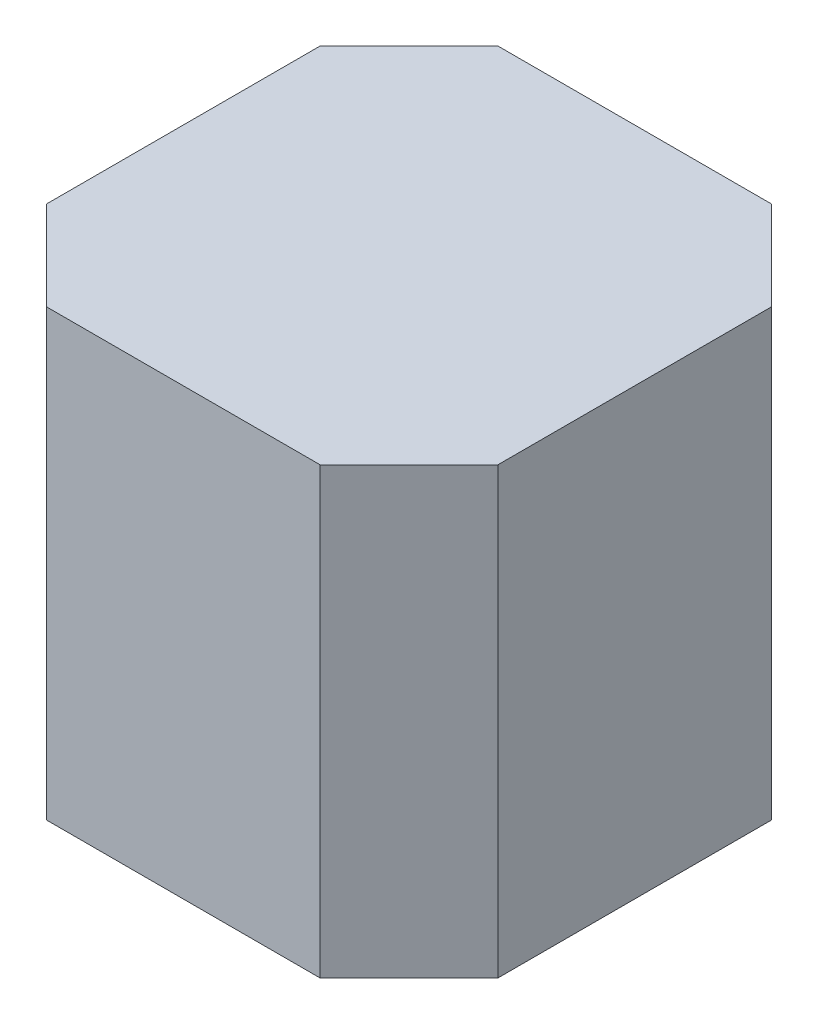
from build123d import *

# Parameters (mm, degrees)
SKETCH_1_W      = 2.54
SKETCH_1_H      = 2.54
EXTRUDE_1_DEPTH = 2.5
CHAMFER_1_SIZE  = 0.5


with BuildPart() as part:
    # Sketch 1 → Extrude 1 (new body)
    with BuildSketch(Plane(origin=(0, 0, 0), x_dir=(1, 0, 0), z_dir=(0, 1, 0))):
        Rectangle(SKETCH_1_W, SKETCH_1_H)
    extrude(amount=EXTRUDE_1_DEPTH)

    # Chamfer 1
    chamfer_1_edges = [part.edges().sort_by_distance(p)[0] for p in [
        (1.27, 1.25, 1.27),
        (-1.27, 1.25, 1.27),
        (-1.27, 1.25, -1.27),
        (1.27, 1.25, -1.27),
    ]]
    chamfer(chamfer_1_edges, length=CHAMFER_1_SIZE)


solid = part.part
